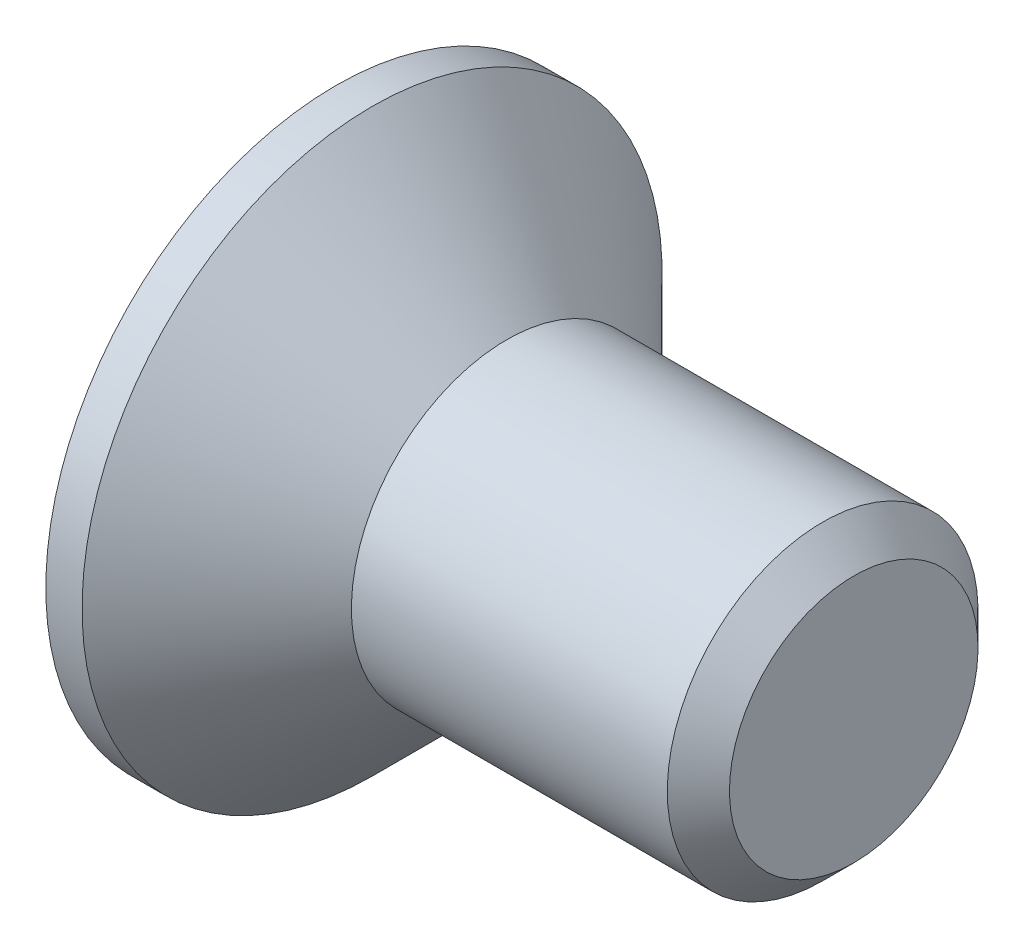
from build123d import *

# Parameters (mm, degrees)
CHAMFER1_SIZE      = 0.3
CUT_EXTRUDE1_DEPTH = 1.25


with BuildPart() as part:
    # Sketch1 → Revolve1 (revolve)
    with BuildSketch(Plane.XY, mode=Mode.PRIVATE) as revolve1_sk:
        Polygon((-1.65, 2.8), (-1.65, 0), (3.35, 0), (3.35, 1.5), (0, 1.5), (-1.3, 2.8), align=None)
    revolve(revolve1_sk.sketch.rotate(Axis((-1.65, 0, 0), (1, 0, 0)), 180), axis=Axis((-1.65, 0, 0), (1, 0, 0)))

    # Chamfer1
    chamfer1_edges = [part.edges().sort_by_distance(p)[0] for p in [
        (3.35, 1.5, 0),
    ]]
    chamfer(chamfer1_edges, length=CHAMFER1_SIZE)

    # Sketch2 → Cut-Extrude1 (cut)
    with BuildSketch(Plane.ZY.offset(1.65)):
        Polygon((-0.365, 1.45), (0.365, 1.45), (0.365, 0.365), (1.45, 0.365), (1.45, -0.365), (0.365, -0.365), (0.365, -1.45), (-0.365, -1.45), (-0.365, -0.365), (-1.45, -0.365), (-1.45, 0.365), (-0.365, 0.365), align=None)
    extrude(amount=-CUT_EXTRUDE1_DEPTH, mode=Mode.SUBTRACT)


solid = part.part
